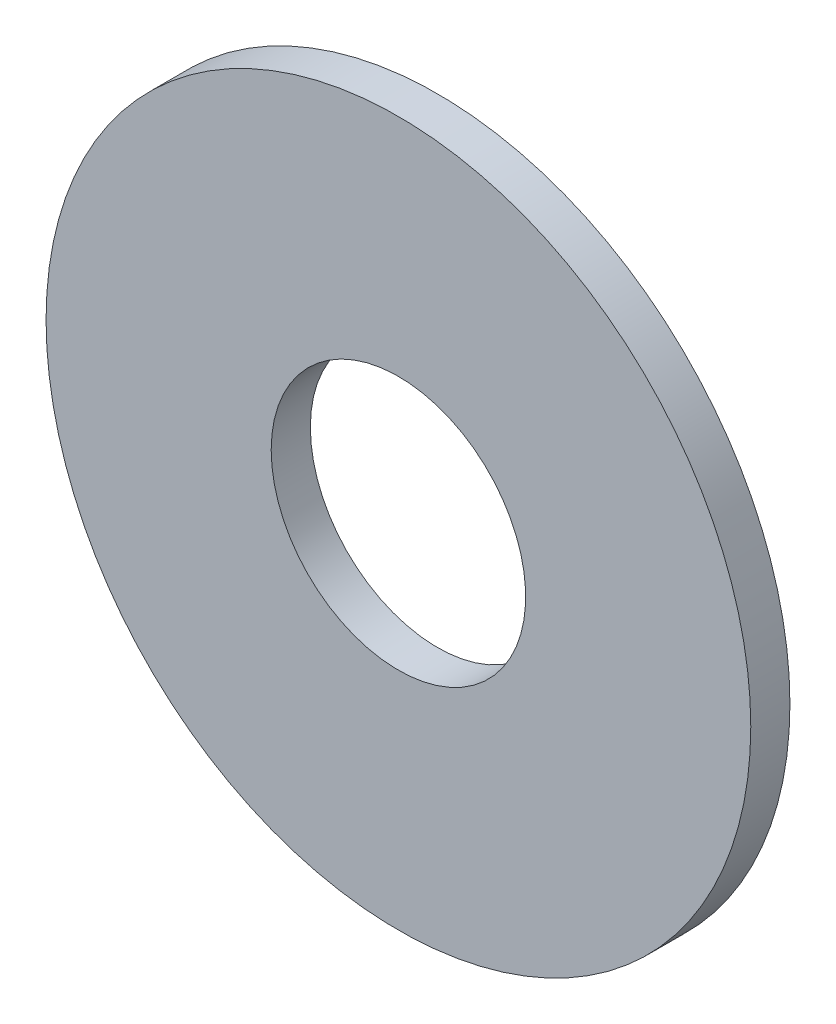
from build123d import *

# Parameters (mm, degrees)
SKETCH_1_R        = 9
SKETCH_1_R_2      = 3.25
EXTRUDE_279_DEPTH = 1


with BuildPart() as part:
    # Sketch 1 → Extrude 279 (new body)
    with BuildSketch(Plane.XY):
        with Locations(Location((-10, -20, 0), (0, 0, 180))):
            Circle(SKETCH_1_R)
        with Locations(Location((-10, -20, 0), (0, 0, 180))):
            Circle(SKETCH_1_R_2, mode=Mode.SUBTRACT)
    extrude(amount=EXTRUDE_279_DEPTH)


solid = part.part
